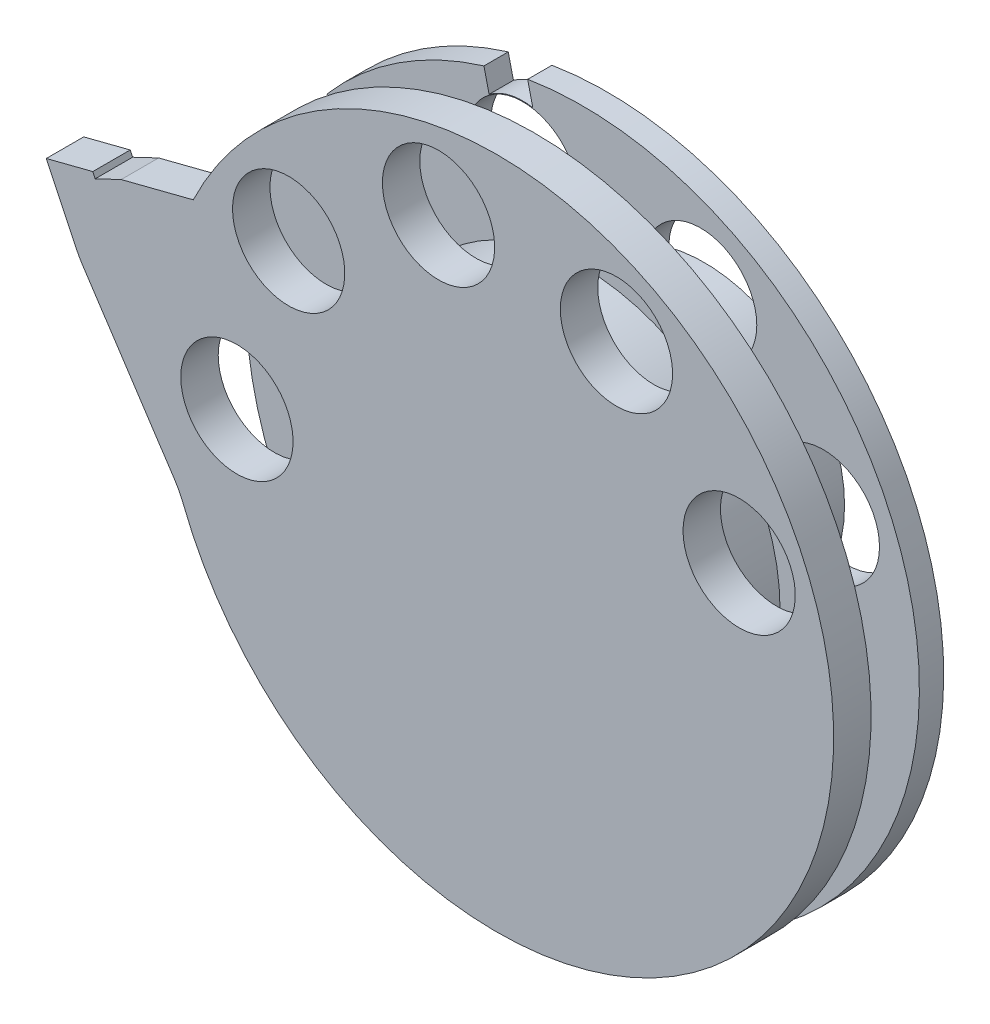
ISO-10303-21;
HEADER;
FILE_DESCRIPTION(('STEP AP214'),'2;1');
FILE_NAME('part.step','',(''),(''),'','','');
FILE_SCHEMA(('AUTOMOTIVE_DESIGN { 1 0 10303 214 1 1 1 1 }'));
ENDSEC;
DATA;
#1=APPLICATION_CONTEXT('core data for automotive mechanical design processes');
#2=APPLICATION_PROTOCOL_DEFINITION('international standard','automotive_design',2000,#1);
#3=PRODUCT_CONTEXT('',#1,'mechanical');
#4=PRODUCT('Part','Part','',(#3));
#5=PRODUCT_RELATED_PRODUCT_CATEGORY('part','',(#4));
#6=PRODUCT_DEFINITION_FORMATION('','',#4);
#7=PRODUCT_DEFINITION_CONTEXT('part definition',#1,'design');
#8=PRODUCT_DEFINITION('design','',#6,#7);
#9=PRODUCT_DEFINITION_SHAPE('','',#8);
#10=(LENGTH_UNIT() NAMED_UNIT(*) SI_UNIT(.MILLI.,.METRE.));
#11=(NAMED_UNIT(*) PLANE_ANGLE_UNIT() SI_UNIT($,.RADIAN.));
#12=(NAMED_UNIT(*) SI_UNIT($,.STERADIAN.) SOLID_ANGLE_UNIT());
#13=UNCERTAINTY_MEASURE_WITH_UNIT(LENGTH_MEASURE(1.E-05),#10,'distance_accuracy_value','');
#14=(GEOMETRIC_REPRESENTATION_CONTEXT(3) GLOBAL_UNCERTAINTY_ASSIGNED_CONTEXT((#13)) GLOBAL_UNIT_ASSIGNED_CONTEXT((#10,
#11,#12)) REPRESENTATION_CONTEXT('',''));
#15=CARTESIAN_POINT('',(0.,0.,0.));
#16=DIRECTION('',(0.,0.,1.));
#17=DIRECTION('',(1.,0.,0.));
#18=AXIS2_PLACEMENT_3D('',#15,#16,#17);
#19=CARTESIAN_POINT('',(0.,0.,1.3));
#20=DIRECTION('',(0.,0.,1.));
#21=DIRECTION('',(1.,0.,0.));
#22=AXIS2_PLACEMENT_3D('',#19,#20,#21);
#23=PLANE('',#22);
#24=CARTESIAN_POINT('',(6.30816552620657,12.4982817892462,1.3));
#25=DIRECTION('',(0.,0.,1.));
#26=DIRECTION('',(1.,0.,0.));
#27=AXIS2_PLACEMENT_3D('',#24,#25,#26);
#28=CIRCLE('',#27,3.00000000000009);
#29=CARTESIAN_POINT('',(9.30816552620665,12.4982817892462,1.3));
#30=VERTEX_POINT('',#29);
#31=EDGE_CURVE('E266',#30,#30,#28,.T.);
#32=ORIENTED_EDGE('',*,*,#31,.F.);
#33=EDGE_LOOP('',(#32));
#34=FACE_BOUND('',#33,.T.);
#35=CARTESIAN_POINT('',(-3.201405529,13.5914772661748,1.3));
#36=DIRECTION('',(0.,0.,1.));
#37=DIRECTION('',(1.,0.,0.));
#38=AXIS2_PLACEMENT_3D('',#35,#36,#37);
#39=CIRCLE('',#38,3.00000000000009);
#40=CARTESIAN_POINT('',(-0.201405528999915,13.5914772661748,1.3));
#41=VERTEX_POINT('',#40);
#42=EDGE_CURVE('E262',#41,#41,#39,.T.);
#43=ORIENTED_EDGE('',*,*,#42,.F.);
#44=EDGE_LOOP('',(#43));
#45=FACE_BOUND('',#44,.T.);
#46=CARTESIAN_POINT('',(12.866075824,5.519428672,1.3));
#47=DIRECTION('',(0.,0.,1.));
#48=DIRECTION('',(1.,0.,0.));
#49=AXIS2_PLACEMENT_3D('',#46,#47,#48);
#50=CIRCLE('',#49,3.00000000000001);
#51=CARTESIAN_POINT('',(15.866075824,5.519428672,1.3));
#52=VERTEX_POINT('',#51);
#53=EDGE_CURVE('E240',#52,#52,#50,.T.);
#54=ORIENTED_EDGE('',*,*,#53,.F.);
#55=EDGE_LOOP('',(#54));
#56=FACE_BOUND('',#55,.T.);
#57=CARTESIAN_POINT('',(0.,0.,1.3));
#58=DIRECTION('',(0.,0.,1.));
#59=DIRECTION('',(1.,0.,0.));
#60=AXIS2_PLACEMENT_3D('',#57,#58,#59);
#61=CIRCLE('',#60,10.55);
#62=CARTESIAN_POINT('',(10.55,0.,1.3));
#63=VERTEX_POINT('',#62);
#64=EDGE_CURVE('E256',#63,#63,#61,.T.);
#65=ORIENTED_EDGE('',*,*,#64,.F.);
#66=EDGE_LOOP('',(#65));
#67=FACE_BOUND('',#66,.T.);
#68=CARTESIAN_POINT('',(0.,0.,1.3));
#69=DIRECTION('',(0.,0.,1.));
#70=DIRECTION('',(1.,0.,0.));
#71=AXIS2_PLACEMENT_3D('',#68,#69,#70);
#72=CIRCLE('',#71,18.);
#73=CARTESIAN_POINT('',(-15.1031572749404,9.7925808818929,1.3));
#74=VERTEX_POINT('',#73);
#75=CARTESIAN_POINT('',(-17.9990009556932,0.189643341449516,1.3));
#76=VERTEX_POINT('',#75);
#77=EDGE_CURVE('E272',#74,#76,#72,.T.);
#78=ORIENTED_EDGE('',*,*,#77,.T.);
#79=DIRECTION('',(0.998422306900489,0.0561506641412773,0.));
#80=VECTOR('',#79,1.);
#81=CARTESIAN_POINT('',(-0.0673807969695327,1.19810676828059,1.3));
#82=LINE('',#81,#80);
#83=CARTESIAN_POINT('',(-16.7905005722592,0.257608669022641,1.3));
#84=VERTEX_POINT('',#83);
#85=EDGE_CURVE('E773',#76,#84,#82,.T.);
#86=ORIENTED_EDGE('',*,*,#85,.T.);
#87=CARTESIAN_POINT('',(-13.977912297,-0.786109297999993,1.3));
#88=DIRECTION('',(0.,0.,1.));
#89=DIRECTION('',(1.,0.,0.));
#90=AXIS2_PLACEMENT_3D('',#87,#88,#89);
#91=CIRCLE('',#90,3.00000000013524);
#92=CARTESIAN_POINT('',(-16.6557389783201,-2.13860486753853,1.3));
#93=VERTEX_POINT('',#92);
#94=EDGE_CURVE('E247',#93,#84,#91,.T.);
#95=ORIENTED_EDGE('',*,*,#94,.F.);
#96=DIRECTION('',(0.998422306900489,0.0561506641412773,0.));
#97=VECTOR('',#96,1.);
#98=CARTESIAN_POINT('',(0.0673807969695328,-1.19810676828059,1.3));
#99=LINE('',#98,#97);
#100=CARTESIAN_POINT('',(-17.8642393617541,-2.20657019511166,1.3));
#101=VERTEX_POINT('',#100);
#102=EDGE_CURVE('E770',#101,#93,#99,.T.);
#103=ORIENTED_EDGE('',*,*,#102,.F.);
#104=CARTESIAN_POINT('',(-2.93873148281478,17.7584869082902,1.3));
#105=VERTEX_POINT('',#104);
#106=EDGE_CURVE('E219',#101,#105,#72,.T.);
#107=ORIENTED_EDGE('',*,*,#106,.T.);
#108=DIRECTION('',(0.228671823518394,-0.973503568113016,0.));
#109=VECTOR('',#108,1.);
#110=CARTESIAN_POINT('',(1.16820428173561,0.274406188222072,1.3));
#111=LINE('',#110,#109);
#112=CARTESIAN_POINT('',(-2.66194481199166,16.5801484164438,1.3));
#113=VERTEX_POINT('',#112);
#114=EDGE_CURVE('E755',#105,#113,#111,.T.);
#115=ORIENTED_EDGE('',*,*,#114,.T.);
#116=CARTESIAN_POINT('',(-3.20140552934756,13.6290499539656,1.3));
#117=DIRECTION('',(0.,0.,1.));
#118=DIRECTION('',(1.,0.,0.));
#119=AXIS2_PLACEMENT_3D('',#116,#117,#118);
#120=CIRCLE('',#119,3.00000000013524);
#121=CARTESIAN_POINT('',(-4.99835337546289,16.0313360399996,1.3));
#122=VERTEX_POINT('',#121);
#123=EDGE_CURVE('E759',#113,#122,#120,.T.);
#124=ORIENTED_EDGE('',*,*,#123,.T.);
#125=DIRECTION('',(0.228671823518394,-0.973503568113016,0.));
#126=VECTOR('',#125,1.);
#127=CARTESIAN_POINT('',(-1.16820428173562,-0.274406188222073,1.3));
#128=LINE('',#127,#126);
#129=CARTESIAN_POINT('',(-5.27514004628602,17.209674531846,1.3));
#130=VERTEX_POINT('',#129);
#131=EDGE_CURVE('E712',#130,#122,#128,.T.);
#132=ORIENTED_EDGE('',*,*,#131,.F.);
#133=CARTESIAN_POINT('',(-13.6661342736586,11.7148100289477,1.3));
#134=VERTEX_POINT('',#133);
#135=EDGE_CURVE('E273',#130,#134,#72,.T.);
#136=ORIENTED_EDGE('',*,*,#135,.T.);
#137=DIRECTION('',(0.800928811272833,-0.598759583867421,0.));
#138=VECTOR('',#137,1.);
#139=CARTESIAN_POINT('',(0.71851150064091,0.961114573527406,1.3));
#140=LINE('',#139,#138);
#141=CARTESIAN_POINT('',(-12.6966819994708,10.9900654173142,1.3));
#142=VERTEX_POINT('',#141);
#143=EDGE_CURVE('E766',#134,#142,#140,.T.);
#144=ORIENTED_EDGE('',*,*,#143,.T.);
#145=CARTESIAN_POINT('',(-11.213003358,8.38263417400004,1.3));
#146=DIRECTION('',(0.,0.,1.));
#147=DIRECTION('',(1.,0.,0.));
#148=AXIS2_PLACEMENT_3D('',#145,#146,#147);
#149=CIRCLE('',#148,2.99999999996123);
#150=CARTESIAN_POINT('',(-14.1337050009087,9.06783627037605,1.3));
#151=VERTEX_POINT('',#150);
#152=EDGE_CURVE('E253',#151,#142,#149,.T.);
#153=ORIENTED_EDGE('',*,*,#152,.F.);
#154=DIRECTION('',(0.800928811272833,-0.598759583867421,0.));
#155=VECTOR('',#154,1.);
#156=CARTESIAN_POINT('',(-0.718511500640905,-0.961114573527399,1.3));
#157=LINE('',#156,#155);
#158=EDGE_CURVE('E763',#74,#151,#157,.T.);
#159=ORIENTED_EDGE('',*,*,#158,.F.);
#160=EDGE_LOOP('',(#78,#86,#95,#103,#107,#115,#124,#132,#136,#144,#153,#159));
#161=FACE_BOUND('',#160,.T.);
#162=ADVANCED_FACE('F53',(#34,#45,#56,#67,#161),#23,.T.);
#163=CARTESIAN_POINT('',(-11.213003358,8.38263417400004,1.3));
#164=DIRECTION('',(0.,0.,-1.));
#165=DIRECTION('',(-1.,0.,0.));
#166=AXIS2_PLACEMENT_3D('',#163,#164,#165);
#167=CYLINDRICAL_SURFACE('',#166,2.99999999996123);
#168=ORIENTED_EDGE('',*,*,#152,.T.);
#169=DIRECTION('',(0.,0.,-1.));
#170=VECTOR('',#169,1.);
#171=CARTESIAN_POINT('',(-12.6966819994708,10.9900654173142,2.5));
#172=LINE('',#171,#170);
#173=CARTESIAN_POINT('',(-12.6966819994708,10.9900654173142,0.));
#174=VERTEX_POINT('',#173);
#175=EDGE_CURVE('E725',#142,#174,#172,.T.);
#176=ORIENTED_EDGE('',*,*,#175,.T.);
#177=CARTESIAN_POINT('',(-11.213003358,8.38263417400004,0.));
#178=DIRECTION('',(0.,0.,1.));
#179=DIRECTION('',(1.,0.,0.));
#180=AXIS2_PLACEMENT_3D('',#177,#178,#179);
#181=CIRCLE('',#180,2.99999999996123);
#182=CARTESIAN_POINT('',(-14.1337050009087,9.06783627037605,0.));
#183=VERTEX_POINT('',#182);
#184=EDGE_CURVE('E282',#183,#174,#181,.T.);
#185=ORIENTED_EDGE('',*,*,#184,.F.);
#186=DIRECTION('',(0.,0.,-1.));
#187=VECTOR('',#186,1.);
#188=CARTESIAN_POINT('',(-14.1337050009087,9.06783627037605,2.5));
#189=LINE('',#188,#187);
#190=EDGE_CURVE('E732',#151,#183,#189,.T.);
#191=ORIENTED_EDGE('',*,*,#190,.F.);
#192=EDGE_LOOP('',(#168,#176,#185,#191));
#193=FACE_BOUND('',#192,.T.);
#194=ADVANCED_FACE('F308',(#193),#167,.F.);
#195=CARTESIAN_POINT('',(-13.977912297,-0.786109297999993,1.3));
#196=DIRECTION('',(0.,0.,-1.));
#197=DIRECTION('',(-1.,0.,0.));
#198=AXIS2_PLACEMENT_3D('',#195,#196,#197);
#199=CYLINDRICAL_SURFACE('',#198,3.00000000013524);
#200=ORIENTED_EDGE('',*,*,#94,.T.);
#201=DIRECTION('',(0.,0.,-1.));
#202=VECTOR('',#201,1.);
#203=CARTESIAN_POINT('',(-16.7905005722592,0.257608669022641,2.5));
#204=LINE('',#203,#202);
#205=CARTESIAN_POINT('',(-16.7905005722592,0.257608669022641,0.));
#206=VERTEX_POINT('',#205);
#207=EDGE_CURVE('E708',#84,#206,#204,.T.);
#208=ORIENTED_EDGE('',*,*,#207,.T.);
#209=CARTESIAN_POINT('',(-13.977912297,-0.786109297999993,0.));
#210=DIRECTION('',(0.,0.,1.));
#211=DIRECTION('',(1.,0.,0.));
#212=AXIS2_PLACEMENT_3D('',#209,#210,#211);
#213=CIRCLE('',#212,3.00000000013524);
#214=CARTESIAN_POINT('',(-16.6557389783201,-2.13860486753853,0.));
#215=VERTEX_POINT('',#214);
#216=EDGE_CURVE('E278',#215,#206,#213,.T.);
#217=ORIENTED_EDGE('',*,*,#216,.F.);
#218=DIRECTION('',(0.,0.,-1.));
#219=VECTOR('',#218,1.);
#220=CARTESIAN_POINT('',(-16.6557389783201,-2.13860486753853,2.5));
#221=LINE('',#220,#219);
#222=EDGE_CURVE('E203',#93,#215,#221,.T.);
#223=ORIENTED_EDGE('',*,*,#222,.F.);
#224=EDGE_LOOP('',(#200,#208,#217,#223));
#225=FACE_BOUND('',#224,.T.);
#226=ADVANCED_FACE('F314',(#225),#199,.F.);
#227=CARTESIAN_POINT('',(0.,0.,1.3));
#228=DIRECTION('',(0.,0.,-1.));
#229=DIRECTION('',(-1.,0.,0.));
#230=AXIS2_PLACEMENT_3D('',#227,#228,#229);
#231=CYLINDRICAL_SURFACE('',#230,18.);
#232=DIRECTION('',(0.,0.,-1.));
#233=VECTOR('',#232,1.);
#234=CARTESIAN_POINT('',(-17.9990009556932,0.189643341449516,2.5));
#235=LINE('',#234,#233);
#236=CARTESIAN_POINT('',(-17.9990009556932,0.189643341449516,0.));
#237=VERTEX_POINT('',#236);
#238=EDGE_CURVE('E77',#76,#237,#235,.T.);
#239=ORIENTED_EDGE('',*,*,#238,.F.);
#240=ORIENTED_EDGE('',*,*,#77,.F.);
#241=DIRECTION('',(0.,0.,-1.));
#242=VECTOR('',#241,1.);
#243=CARTESIAN_POINT('',(-15.1031572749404,9.7925808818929,2.5));
#244=LINE('',#243,#242);
#245=CARTESIAN_POINT('',(-15.1031572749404,9.7925808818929,0.));
#246=VERTEX_POINT('',#245);
#247=EDGE_CURVE('E728',#74,#246,#244,.T.);
#248=ORIENTED_EDGE('',*,*,#247,.T.);
#249=CARTESIAN_POINT('',(0.,0.,0.));
#250=DIRECTION('',(0.,0.,1.));
#251=DIRECTION('',(1.,0.,0.));
#252=AXIS2_PLACEMENT_3D('',#249,#250,#251);
#253=CIRCLE('',#252,18.);
#254=EDGE_CURVE('E227',#246,#237,#253,.T.);
#255=ORIENTED_EDGE('',*,*,#254,.T.);
#256=EDGE_LOOP('',(#239,#240,#248,#255));
#257=FACE_BOUND('',#256,.T.);
#258=ADVANCED_FACE('F325',(#257),#231,.T.);
#259=DIRECTION('',(0.,0.,-1.));
#260=VECTOR('',#259,1.);
#261=CARTESIAN_POINT('',(-13.6661342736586,11.7148100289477,2.5));
#262=LINE('',#261,#260);
#263=CARTESIAN_POINT('',(-13.6661342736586,11.7148100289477,0.));
#264=VERTEX_POINT('',#263);
#265=EDGE_CURVE('E210',#134,#264,#262,.T.);
#266=ORIENTED_EDGE('',*,*,#265,.F.);
#267=ORIENTED_EDGE('',*,*,#135,.F.);
#268=DIRECTION('',(0.,0.,-1.));
#269=VECTOR('',#268,1.);
#270=CARTESIAN_POINT('',(-5.27514004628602,17.209674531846,2.5));
#271=LINE('',#270,#269);
#272=CARTESIAN_POINT('',(-5.27514004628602,17.209674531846,0.));
#273=VERTEX_POINT('',#272);
#274=EDGE_CURVE('E748',#130,#273,#271,.T.);
#275=ORIENTED_EDGE('',*,*,#274,.T.);
#276=EDGE_CURVE('E230',#273,#264,#253,.T.);
#277=ORIENTED_EDGE('',*,*,#276,.T.);
#278=EDGE_LOOP('',(#266,#267,#275,#277));
#279=FACE_BOUND('',#278,.T.);
#280=ADVANCED_FACE('F327',(#279),#231,.T.);
#281=ORIENTED_EDGE('',*,*,#106,.F.);
#282=DIRECTION('',(0.,0.,-1.));
#283=VECTOR('',#282,1.);
#284=CARTESIAN_POINT('',(-17.8642393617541,-2.20657019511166,2.5));
#285=LINE('',#284,#283);
#286=CARTESIAN_POINT('',(-17.8642393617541,-2.20657019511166,0.));
#287=VERTEX_POINT('',#286);
#288=EDGE_CURVE('E200',#101,#287,#285,.T.);
#289=ORIENTED_EDGE('',*,*,#288,.T.);
#290=CARTESIAN_POINT('',(-2.93873148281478,17.7584869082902,0.));
#291=VERTEX_POINT('',#290);
#292=EDGE_CURVE('E217',#287,#291,#253,.T.);
#293=ORIENTED_EDGE('',*,*,#292,.T.);
#294=DIRECTION('',(0.,0.,-1.));
#295=VECTOR('',#294,1.);
#296=CARTESIAN_POINT('',(-2.93873148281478,17.7584869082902,2.5));
#297=LINE('',#296,#295);
#298=EDGE_CURVE('E745',#105,#291,#297,.T.);
#299=ORIENTED_EDGE('',*,*,#298,.F.);
#300=EDGE_LOOP('',(#281,#289,#293,#299));
#301=FACE_BOUND('',#300,.T.);
#302=ADVANCED_FACE('F215',(#301),#231,.T.);
#303=CARTESIAN_POINT('',(0.,0.,0.));
#304=DIRECTION('',(0.,0.,1.));
#305=DIRECTION('',(1.,0.,0.));
#306=AXIS2_PLACEMENT_3D('',#303,#304,#305);
#307=PLANE('',#306);
#308=CARTESIAN_POINT('',(6.30816552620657,12.4982817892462,0.));
#309=DIRECTION('',(0.,0.,1.));
#310=DIRECTION('',(1.,0.,0.));
#311=AXIS2_PLACEMENT_3D('',#308,#309,#310);
#312=CIRCLE('',#311,3.00000000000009);
#313=CARTESIAN_POINT('',(9.30816552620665,12.4982817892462,0.));
#314=VERTEX_POINT('',#313);
#315=EDGE_CURVE('E228',#314,#314,#312,.T.);
#316=ORIENTED_EDGE('',*,*,#315,.T.);
#317=EDGE_LOOP('',(#316));
#318=FACE_BOUND('',#317,.T.);
#319=CARTESIAN_POINT('',(-3.201405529,13.5914772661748,0.));
#320=DIRECTION('',(0.,0.,1.));
#321=DIRECTION('',(1.,0.,0.));
#322=AXIS2_PLACEMENT_3D('',#319,#320,#321);
#323=CIRCLE('',#322,3.00000000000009);
#324=CARTESIAN_POINT('',(-0.201405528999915,13.5914772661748,0.));
#325=VERTEX_POINT('',#324);
#326=EDGE_CURVE('E235',#325,#325,#323,.T.);
#327=ORIENTED_EDGE('',*,*,#326,.T.);
#328=EDGE_LOOP('',(#327));
#329=FACE_BOUND('',#328,.T.);
#330=CARTESIAN_POINT('',(12.866075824,5.519428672,0.));
#331=DIRECTION('',(0.,0.,1.));
#332=DIRECTION('',(1.,0.,0.));
#333=AXIS2_PLACEMENT_3D('',#330,#331,#332);
#334=CIRCLE('',#333,3.00000000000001);
#335=CARTESIAN_POINT('',(15.866075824,5.519428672,0.));
#336=VERTEX_POINT('',#335);
#337=EDGE_CURVE('E274',#336,#336,#334,.T.);
#338=ORIENTED_EDGE('',*,*,#337,.T.);
#339=EDGE_LOOP('',(#338));
#340=FACE_BOUND('',#339,.T.);
#341=CARTESIAN_POINT('',(0.,0.,0.));
#342=DIRECTION('',(0.,0.,1.));
#343=DIRECTION('',(1.,0.,0.));
#344=AXIS2_PLACEMENT_3D('',#341,#342,#343);
#345=CIRCLE('',#344,10.25);
#346=CARTESIAN_POINT('',(10.25,0.,0.));
#347=VERTEX_POINT('',#346);
#348=EDGE_CURVE('E927',#347,#347,#345,.T.);
#349=ORIENTED_EDGE('',*,*,#348,.T.);
#350=EDGE_LOOP('',(#349));
#351=FACE_BOUND('',#350,.T.);
#352=DIRECTION('',(-0.998422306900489,-0.0561506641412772,0.));
#353=VECTOR('',#352,1.);
#354=CARTESIAN_POINT('',(-0.0673807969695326,1.19810676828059,0.));
#355=LINE('',#354,#353);
#356=EDGE_CURVE('E209',#206,#237,#355,.T.);
#357=ORIENTED_EDGE('',*,*,#356,.T.);
#358=ORIENTED_EDGE('',*,*,#254,.F.);
#359=DIRECTION('',(-0.800928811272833,0.598759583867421,0.));
#360=VECTOR('',#359,1.);
#361=CARTESIAN_POINT('',(-0.718511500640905,-0.961114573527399,0.));
#362=LINE('',#361,#360);
#363=EDGE_CURVE('E721',#183,#246,#362,.T.);
#364=ORIENTED_EDGE('',*,*,#363,.F.);
#365=ORIENTED_EDGE('',*,*,#184,.T.);
#366=DIRECTION('',(-0.800928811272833,0.598759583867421,0.));
#367=VECTOR('',#366,1.);
#368=CARTESIAN_POINT('',(0.71851150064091,0.961114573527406,0.));
#369=LINE('',#368,#367);
#370=EDGE_CURVE('E717',#174,#264,#369,.T.);
#371=ORIENTED_EDGE('',*,*,#370,.T.);
#372=ORIENTED_EDGE('',*,*,#276,.F.);
#373=DIRECTION('',(-0.228671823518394,0.973503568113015,0.));
#374=VECTOR('',#373,1.);
#375=CARTESIAN_POINT('',(-1.16820428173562,-0.274406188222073,0.));
#376=LINE('',#375,#374);
#377=CARTESIAN_POINT('',(-4.9983533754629,16.0313360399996,0.));
#378=VERTEX_POINT('',#377);
#379=EDGE_CURVE('E701',#378,#273,#376,.T.);
#380=ORIENTED_EDGE('',*,*,#379,.F.);
#381=CARTESIAN_POINT('',(-3.20140552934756,13.6290499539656,0.));
#382=DIRECTION('',(0.,0.,-1.));
#383=DIRECTION('',(-1.,0.,0.));
#384=AXIS2_PLACEMENT_3D('',#381,#382,#383);
#385=CIRCLE('',#384,3.00000000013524);
#386=CARTESIAN_POINT('',(-2.66194481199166,16.5801484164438,0.));
#387=VERTEX_POINT('',#386);
#388=EDGE_CURVE('E69',#378,#387,#385,.T.);
#389=ORIENTED_EDGE('',*,*,#388,.T.);
#390=DIRECTION('',(-0.228671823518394,0.973503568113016,0.));
#391=VECTOR('',#390,1.);
#392=CARTESIAN_POINT('',(1.16820428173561,0.274406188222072,0.));
#393=LINE('',#392,#391);
#394=EDGE_CURVE('E225',#387,#291,#393,.T.);
#395=ORIENTED_EDGE('',*,*,#394,.T.);
#396=ORIENTED_EDGE('',*,*,#292,.F.);
#397=DIRECTION('',(-0.998422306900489,-0.0561506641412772,0.));
#398=VECTOR('',#397,1.);
#399=CARTESIAN_POINT('',(0.0673807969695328,-1.19810676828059,0.));
#400=LINE('',#399,#398);
#401=EDGE_CURVE('E197',#215,#287,#400,.T.);
#402=ORIENTED_EDGE('',*,*,#401,.F.);
#403=ORIENTED_EDGE('',*,*,#216,.T.);
#404=EDGE_LOOP('',(#357,#358,#364,#365,#371,#372,#380,#389,#395,#396,#402,#403));
#405=FACE_BOUND('',#404,.T.);
#406=ADVANCED_FACE('F223',(#318,#329,#340,#351,#405),#307,.F.);
#407=CARTESIAN_POINT('',(6.30816552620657,12.4982817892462,1.3));
#408=DIRECTION('',(0.,0.,-1.));
#409=DIRECTION('',(-1.,0.,0.));
#410=AXIS2_PLACEMENT_3D('',#407,#408,#409);
#411=CYLINDRICAL_SURFACE('',#410,3.00000000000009);
#412=ORIENTED_EDGE('',*,*,#31,.T.);
#413=EDGE_LOOP('',(#412));
#414=FACE_BOUND('',#413,.T.);
#415=ORIENTED_EDGE('',*,*,#315,.F.);
#416=EDGE_LOOP('',(#415));
#417=FACE_BOUND('',#416,.T.);
#418=ADVANCED_FACE('F295',(#414,#417),#411,.F.);
#419=CARTESIAN_POINT('',(-3.201405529,13.5914772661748,1.3));
#420=DIRECTION('',(0.,0.,-1.));
#421=DIRECTION('',(-1.,0.,0.));
#422=AXIS2_PLACEMENT_3D('',#419,#420,#421);
#423=CYLINDRICAL_SURFACE('',#422,3.00000000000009);
#424=ORIENTED_EDGE('',*,*,#42,.T.);
#425=EDGE_LOOP('',(#424));
#426=FACE_BOUND('',#425,.T.);
#427=ORIENTED_EDGE('',*,*,#326,.F.);
#428=EDGE_LOOP('',(#427));
#429=FACE_BOUND('',#428,.T.);
#430=ADVANCED_FACE('F292',(#426,#429),#423,.F.);
#431=CARTESIAN_POINT('',(12.866075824,5.519428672,1.3));
#432=DIRECTION('',(0.,0.,-1.));
#433=DIRECTION('',(-1.,0.,0.));
#434=AXIS2_PLACEMENT_3D('',#431,#432,#433);
#435=CYLINDRICAL_SURFACE('',#434,3.00000000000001);
#436=ORIENTED_EDGE('',*,*,#53,.T.);
#437=EDGE_LOOP('',(#436));
#438=FACE_BOUND('',#437,.T.);
#439=ORIENTED_EDGE('',*,*,#337,.F.);
#440=EDGE_LOOP('',(#439));
#441=FACE_BOUND('',#440,.T.);
#442=ADVANCED_FACE('F294',(#438,#441),#435,.F.);
#443=CARTESIAN_POINT('',(0.,0.,1.3));
#444=DIRECTION('',(0.,0.,-1.));
#445=DIRECTION('',(-1.,0.,0.));
#446=AXIS2_PLACEMENT_3D('',#443,#444,#445);
#447=CYLINDRICAL_SURFACE('',#446,9.25);
#448=CARTESIAN_POINT('',(0.,0.,1.));
#449=DIRECTION('',(0.,0.,1.));
#450=DIRECTION('',(1.,0.,0.));
#451=AXIS2_PLACEMENT_3D('',#448,#449,#450);
#452=CIRCLE('',#451,9.25);
#453=CARTESIAN_POINT('',(9.25,0.,1.));
#454=VERTEX_POINT('',#453);
#455=EDGE_CURVE('E62',#454,#454,#452,.F.);
#456=ORIENTED_EDGE('',*,*,#455,.T.);
#457=EDGE_LOOP('',(#456));
#458=FACE_BOUND('',#457,.T.);
#459=CARTESIAN_POINT('',(0.,0.,2.8));
#460=DIRECTION('',(0.,0.,-1.));
#461=DIRECTION('',(-1.,0.,0.));
#462=AXIS2_PLACEMENT_3D('',#459,#460,#461);
#463=CIRCLE('',#462,9.25);
#464=CARTESIAN_POINT('',(-9.25,0.,2.8));
#465=VERTEX_POINT('',#464);
#466=EDGE_CURVE('E932',#465,#465,#463,.F.);
#467=ORIENTED_EDGE('',*,*,#466,.T.);
#468=EDGE_LOOP('',(#467));
#469=FACE_BOUND('',#468,.T.);
#470=ADVANCED_FACE('F302',(#458,#469),#447,.F.);
#471=CARTESIAN_POINT('',(0.,0.,3.8));
#472=DIRECTION('',(0.,0.,-1.));
#473=DIRECTION('',(-1.,0.,0.));
#474=AXIS2_PLACEMENT_3D('',#471,#472,#473);
#475=CYLINDRICAL_SURFACE('',#474,10.55);
#476=CARTESIAN_POINT('',(0.,0.,3.8));
#477=DIRECTION('',(0.,0.,1.));
#478=DIRECTION('',(1.,0.,0.));
#479=AXIS2_PLACEMENT_3D('',#476,#477,#478);
#480=CIRCLE('',#479,10.55);
#481=CARTESIAN_POINT('',(10.55,0.,3.8));
#482=VERTEX_POINT('',#481);
#483=EDGE_CURVE('E279',#482,#482,#480,.T.);
#484=ORIENTED_EDGE('',*,*,#483,.F.);
#485=EDGE_LOOP('',(#484));
#486=FACE_BOUND('',#485,.T.);
#487=ORIENTED_EDGE('',*,*,#64,.T.);
#488=EDGE_LOOP('',(#487));
#489=FACE_BOUND('',#488,.T.);
#490=ADVANCED_FACE('F320',(#486,#489),#475,.T.);
#491=CARTESIAN_POINT('',(-18.0493442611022,4.50971566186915,3.8));
#492=DIRECTION('',(0.,0.,-1.));
#493=DIRECTION('',(-1.,0.,0.));
#494=AXIS2_PLACEMENT_3D('',#491,#492,#493);
#495=PLANE('',#494);
#496=CARTESIAN_POINT('',(0.,0.,3.8));
#497=DIRECTION('',(0.,0.,-1.));
#498=DIRECTION('',(-1.,0.,0.));
#499=AXIS2_PLACEMENT_3D('',#496,#497,#498);
#500=CIRCLE('',#499,7.5);
#501=CARTESIAN_POINT('',(-7.5,0.,3.8));
#502=VERTEX_POINT('',#501);
#503=EDGE_CURVE('E697',#502,#502,#500,.T.);
#504=ORIENTED_EDGE('',*,*,#503,.F.);
#505=EDGE_LOOP('',(#504));
#506=FACE_BOUND('',#505,.T.);
#507=CARTESIAN_POINT('',(0.,0.,3.8));
#508=DIRECTION('',(0.,0.,-1.));
#509=DIRECTION('',(-1.,0.,0.));
#510=AXIS2_PLACEMENT_3D('',#507,#508,#509);
#511=CIRCLE('',#510,8.25);
#512=CARTESIAN_POINT('',(-8.25,0.,3.8));
#513=VERTEX_POINT('',#512);
#514=EDGE_CURVE('E13',#513,#513,#511,.T.);
#515=ORIENTED_EDGE('',*,*,#514,.T.);
#516=EDGE_LOOP('',(#515));
#517=FACE_BOUND('',#516,.T.);
#518=ADVANCED_FACE('F373',(#506,#517),#495,.T.);
#519=CARTESIAN_POINT('',(-18.0493442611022,4.50971566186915,5.8));
#520=DIRECTION('',(0.,0.,-1.));
#521=DIRECTION('',(-1.,0.,0.));
#522=AXIS2_PLACEMENT_3D('',#519,#520,#521);
#523=CYLINDRICAL_SURFACE('',#522,5.00000000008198);
#524=CARTESIAN_POINT('',(-18.0493442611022,4.50971566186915,3.8));
#525=DIRECTION('',(0.,0.,1.));
#526=DIRECTION('',(-1.,0.,0.));
#527=AXIS2_PLACEMENT_3D('',#524,#525,#526);
#528=CIRCLE('',#527,5.00000000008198);
#529=CARTESIAN_POINT('',(-22.564231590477,2.36127613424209,3.8));
#530=VERTEX_POINT('',#529);
#531=CARTESIAN_POINT('',(-22.2248850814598,1.75928681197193,3.8));
#532=VERTEX_POINT('',#531);
#533=EDGE_CURVE('E817',#530,#532,#528,.T.);
#534=ORIENTED_EDGE('',*,*,#533,.T.);
#535=DIRECTION('',(0.,0.,-1.));
#536=VECTOR('',#535,1.);
#537=CARTESIAN_POINT('',(-22.2248850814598,1.75928681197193,5.8));
#538=LINE('',#537,#536);
#539=CARTESIAN_POINT('',(-22.2248850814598,1.75928681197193,5.8));
#540=VERTEX_POINT('',#539);
#541=EDGE_CURVE('E906',#540,#532,#538,.T.);
#542=ORIENTED_EDGE('',*,*,#541,.F.);
#543=CARTESIAN_POINT('',(-18.0493442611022,4.50971566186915,5.8));
#544=DIRECTION('',(0.,0.,1.));
#545=DIRECTION('',(-1.,0.,0.));
#546=AXIS2_PLACEMENT_3D('',#543,#544,#545);
#547=CIRCLE('',#546,5.00000000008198);
#548=CARTESIAN_POINT('',(-22.564231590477,2.36127613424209,5.8));
#549=VERTEX_POINT('',#548);
#550=EDGE_CURVE('E818',#549,#540,#547,.T.);
#551=ORIENTED_EDGE('',*,*,#550,.F.);
#552=DIRECTION('',(0.,0.,-1.));
#553=VECTOR('',#552,1.);
#554=CARTESIAN_POINT('',(-22.564231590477,2.36127613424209,5.8));
#555=LINE('',#554,#553);
#556=EDGE_CURVE('E847',#549,#530,#555,.T.);
#557=ORIENTED_EDGE('',*,*,#556,.T.);
#558=EDGE_LOOP('',(#534,#542,#551,#557));
#559=FACE_BOUND('',#558,.T.);
#560=ADVANCED_FACE('F381',(#559),#523,.T.);
#561=CARTESIAN_POINT('',(-17.320583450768,-5.68613816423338,5.8));
#562=DIRECTION('',(0.835108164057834,0.550085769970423,0.));
#563=DIRECTION('',(-0.550085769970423,0.835108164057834,0.));
#564=AXIS2_PLACEMENT_3D('',#561,#562,#563);
#565=PLANE('',#564);
#566=DIRECTION('',(0.550085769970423,-0.835108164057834,0.));
#567=VECTOR('',#566,1.);
#568=CARTESIAN_POINT('',(-17.320583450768,-5.68613816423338,3.8));
#569=LINE('',#568,#567);
#570=CARTESIAN_POINT('',(-17.320583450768,-5.68613816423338,3.8));
#571=VERTEX_POINT('',#570);
#572=EDGE_CURVE('E851',#532,#571,#569,.T.);
#573=ORIENTED_EDGE('',*,*,#572,.T.);
#574=DIRECTION('',(0.,0.,-1.));
#575=VECTOR('',#574,1.);
#576=CARTESIAN_POINT('',(-17.320583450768,-5.68613816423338,5.8));
#577=LINE('',#576,#575);
#578=CARTESIAN_POINT('',(-17.320583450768,-5.68613816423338,5.8));
#579=VERTEX_POINT('',#578);
#580=EDGE_CURVE('E902',#579,#571,#577,.T.);
#581=ORIENTED_EDGE('',*,*,#580,.F.);
#582=DIRECTION('',(0.550085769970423,-0.835108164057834,0.));
#583=VECTOR('',#582,1.);
#584=CARTESIAN_POINT('',(-17.320583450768,-5.68613816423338,5.8));
#585=LINE('',#584,#583);
#586=EDGE_CURVE('E822',#540,#579,#585,.T.);
#587=ORIENTED_EDGE('',*,*,#586,.F.);
#588=ORIENTED_EDGE('',*,*,#541,.T.);
#589=EDGE_LOOP('',(#573,#581,#587,#588));
#590=FACE_BOUND('',#589,.T.);
#591=ADVANCED_FACE('F386',(#590),#565,.F.);
#592=CARTESIAN_POINT('',(-21.4961242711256,-8.43656701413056,5.8));
#593=DIRECTION('',(0.,0.,-1.));
#594=DIRECTION('',(-1.,0.,0.));
#595=AXIS2_PLACEMENT_3D('',#592,#593,#594);
#596=CYLINDRICAL_SURFACE('',#595,5.00000000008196);
#597=CARTESIAN_POINT('',(-21.4961242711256,-8.43656701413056,3.8));
#598=DIRECTION('',(0.,0.,-1.));
#599=DIRECTION('',(-1.,0.,0.));
#600=AXIS2_PLACEMENT_3D('',#597,#598,#599);
#601=CIRCLE('',#600,5.00000000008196);
#602=CARTESIAN_POINT('',(-16.840978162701,-6.61184382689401,3.8));
#603=VERTEX_POINT('',#602);
#604=EDGE_CURVE('E854',#571,#603,#601,.T.);
#605=ORIENTED_EDGE('',*,*,#604,.T.);
#606=DIRECTION('',(0.,0.,-1.));
#607=VECTOR('',#606,1.);
#608=CARTESIAN_POINT('',(-16.840978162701,-6.61184382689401,5.8));
#609=LINE('',#608,#607);
#610=CARTESIAN_POINT('',(-16.840978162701,-6.61184382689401,5.8));
#611=VERTEX_POINT('',#610);
#612=EDGE_CURVE('E898',#611,#603,#609,.T.);
#613=ORIENTED_EDGE('',*,*,#612,.F.);
#614=CARTESIAN_POINT('',(-21.4961242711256,-8.43656701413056,5.8));
#615=DIRECTION('',(0.,0.,-1.));
#616=DIRECTION('',(-1.,0.,0.));
#617=AXIS2_PLACEMENT_3D('',#614,#615,#616);
#618=CIRCLE('',#617,5.00000000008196);
#619=EDGE_CURVE('E826',#579,#611,#618,.T.);
#620=ORIENTED_EDGE('',*,*,#619,.F.);
#621=ORIENTED_EDGE('',*,*,#580,.T.);
#622=EDGE_LOOP('',(#605,#613,#620,#621));
#623=FACE_BOUND('',#622,.T.);
#624=ADVANCED_FACE('F395',(#623),#596,.F.);
#625=CARTESIAN_POINT('',(-0.0824520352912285,-0.0428402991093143,5.8));
#626=DIRECTION('',(0.,0.,-1.));
#627=DIRECTION('',(-1.,0.,0.));
#628=AXIS2_PLACEMENT_3D('',#625,#626,#627);
#629=CYLINDRICAL_SURFACE('',#628,18.0000001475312);
#630=CARTESIAN_POINT('',(-0.0824520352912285,-0.0428402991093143,3.8));
#631=DIRECTION('',(0.,0.,1.));
#632=DIRECTION('',(-1.,0.,0.));
#633=AXIS2_PLACEMENT_3D('',#630,#631,#632);
#634=CIRCLE('',#633,18.0000001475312);
#635=CARTESIAN_POINT('',(-16.3112640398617,7.74340823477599,3.8));
#636=VERTEX_POINT('',#635);
#637=EDGE_CURVE('E858',#603,#636,#634,.T.);
#638=ORIENTED_EDGE('',*,*,#637,.T.);
#639=DIRECTION('',(0.,0.,-1.));
#640=VECTOR('',#639,1.);
#641=CARTESIAN_POINT('',(-16.3112640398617,7.74340823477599,5.8));
#642=LINE('',#641,#640);
#643=CARTESIAN_POINT('',(-16.3112640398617,7.74340823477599,5.8));
#644=VERTEX_POINT('',#643);
#645=EDGE_CURVE('E894',#644,#636,#642,.T.);
#646=ORIENTED_EDGE('',*,*,#645,.F.);
#647=CARTESIAN_POINT('',(-0.0824520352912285,-0.0428402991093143,5.8));
#648=DIRECTION('',(0.,0.,1.));
#649=DIRECTION('',(-1.,0.,0.));
#650=AXIS2_PLACEMENT_3D('',#647,#648,#649);
#651=CIRCLE('',#650,18.0000001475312);
#652=EDGE_CURVE('E829',#611,#644,#651,.T.);
#653=ORIENTED_EDGE('',*,*,#652,.F.);
#654=ORIENTED_EDGE('',*,*,#612,.T.);
#655=EDGE_LOOP('',(#638,#646,#653,#654));
#656=FACE_BOUND('',#655,.T.);
#657=ADVANCED_FACE('F405',(#656),#629,.T.);
#658=CARTESIAN_POINT('',(-20.1631538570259,6.75557326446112,5.8));
#659=DIRECTION('',(0.248415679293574,-0.968653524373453,0.));
#660=DIRECTION('',(0.968653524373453,0.248415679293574,0.));
#661=AXIS2_PLACEMENT_3D('',#658,#659,#660);
#662=PLANE('',#661);
#663=DIRECTION('',(-0.968653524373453,-0.248415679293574,0.));
#664=VECTOR('',#663,1.);
#665=CARTESIAN_POINT('',(-20.1631538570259,6.75557326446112,3.8));
#666=LINE('',#665,#664);
#667=CARTESIAN_POINT('',(-20.1631538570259,6.75557326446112,3.8));
#668=VERTEX_POINT('',#667);
#669=EDGE_CURVE('E861',#636,#668,#666,.T.);
#670=ORIENTED_EDGE('',*,*,#669,.T.);
#671=DIRECTION('',(0.,0.,-1.));
#672=VECTOR('',#671,1.);
#673=CARTESIAN_POINT('',(-20.1631538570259,6.75557326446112,5.8));
#674=LINE('',#673,#672);
#675=CARTESIAN_POINT('',(-20.1631538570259,6.75557326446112,5.8));
#676=VERTEX_POINT('',#675);
#677=EDGE_CURVE('E890',#676,#668,#674,.T.);
#678=ORIENTED_EDGE('',*,*,#677,.F.);
#679=DIRECTION('',(-0.968653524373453,-0.248415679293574,0.));
#680=VECTOR('',#679,1.);
#681=CARTESIAN_POINT('',(-20.1631538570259,6.75557326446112,5.8));
#682=LINE('',#681,#680);
#683=EDGE_CURVE('E832',#644,#676,#682,.T.);
#684=ORIENTED_EDGE('',*,*,#683,.F.);
#685=ORIENTED_EDGE('',*,*,#645,.T.);
#686=EDGE_LOOP('',(#670,#678,#684,#685));
#687=FACE_BOUND('',#686,.T.);
#688=ADVANCED_FACE('F416',(#687),#662,.F.);
#689=CARTESIAN_POINT('',(-21.5522452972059,6.09456475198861,5.8));
#690=DIRECTION('',(0.429687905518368,-0.902977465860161,0.));
#691=DIRECTION('',(0.902977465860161,0.429687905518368,0.));
#692=AXIS2_PLACEMENT_3D('',#689,#690,#691);
#693=PLANE('',#692);
#694=DIRECTION('',(-0.902977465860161,-0.429687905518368,0.));
#695=VECTOR('',#694,1.);
#696=CARTESIAN_POINT('',(-21.5522452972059,6.09456475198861,3.8));
#697=LINE('',#696,#695);
#698=CARTESIAN_POINT('',(-21.5522452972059,6.09456475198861,3.8));
#699=VERTEX_POINT('',#698);
#700=EDGE_CURVE('E864',#668,#699,#697,.T.);
#701=ORIENTED_EDGE('',*,*,#700,.T.);
#702=DIRECTION('',(0.,0.,-1.));
#703=VECTOR('',#702,1.);
#704=CARTESIAN_POINT('',(-21.5522452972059,6.09456475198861,5.8));
#705=LINE('',#704,#703);
#706=CARTESIAN_POINT('',(-21.5522452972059,6.09456475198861,5.8));
#707=VERTEX_POINT('',#706);
#708=EDGE_CURVE('E886',#707,#699,#705,.T.);
#709=ORIENTED_EDGE('',*,*,#708,.F.);
#710=DIRECTION('',(-0.902977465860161,-0.429687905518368,0.));
#711=VECTOR('',#710,1.);
#712=CARTESIAN_POINT('',(-21.5522452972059,6.09456475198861,5.8));
#713=LINE('',#712,#711);
#714=EDGE_CURVE('E835',#676,#707,#713,.T.);
#715=ORIENTED_EDGE('',*,*,#714,.F.);
#716=ORIENTED_EDGE('',*,*,#677,.T.);
#717=EDGE_LOOP('',(#701,#709,#715,#716));
#718=FACE_BOUND('',#717,.T.);
#719=ADVANCED_FACE('F426',(#718),#693,.F.);
#720=CARTESIAN_POINT('',(-21.6814984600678,6.3661867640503,5.8));
#721=DIRECTION('',(-0.902977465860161,-0.429687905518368,0.));
#722=DIRECTION('',(0.429687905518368,-0.902977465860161,0.));
#723=AXIS2_PLACEMENT_3D('',#720,#721,#722);
#724=PLANE('',#723);
#725=DIRECTION('',(-0.429687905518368,0.902977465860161,0.));
#726=VECTOR('',#725,1.);
#727=CARTESIAN_POINT('',(-21.6814984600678,6.3661867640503,3.8));
#728=LINE('',#727,#726);
#729=CARTESIAN_POINT('',(-21.6814984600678,6.3661867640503,3.8));
#730=VERTEX_POINT('',#729);
#731=EDGE_CURVE('E867',#699,#730,#728,.T.);
#732=ORIENTED_EDGE('',*,*,#731,.T.);
#733=DIRECTION('',(0.,0.,-1.));
#734=VECTOR('',#733,1.);
#735=CARTESIAN_POINT('',(-21.6814984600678,6.3661867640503,5.8));
#736=LINE('',#735,#734);
#737=CARTESIAN_POINT('',(-21.6814984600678,6.3661867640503,5.8));
#738=VERTEX_POINT('',#737);
#739=EDGE_CURVE('E882',#738,#730,#736,.T.);
#740=ORIENTED_EDGE('',*,*,#739,.F.);
#741=DIRECTION('',(-0.429687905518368,0.902977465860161,0.));
#742=VECTOR('',#741,1.);
#743=CARTESIAN_POINT('',(-21.6814984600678,6.3661867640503,5.8));
#744=LINE('',#743,#742);
#745=EDGE_CURVE('E838',#707,#738,#744,.T.);
#746=ORIENTED_EDGE('',*,*,#745,.F.);
#747=ORIENTED_EDGE('',*,*,#708,.T.);
#748=EDGE_LOOP('',(#732,#740,#746,#747));
#749=FACE_BOUND('',#748,.T.);
#750=ADVANCED_FACE('F436',(#749),#724,.F.);
#751=CARTESIAN_POINT('',(-24.1667107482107,5.72884257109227,5.8));
#752=DIRECTION('',(0.248415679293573,-0.968653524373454,0.));
#753=DIRECTION('',(0.968653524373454,0.248415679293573,0.));
#754=AXIS2_PLACEMENT_3D('',#751,#752,#753);
#755=PLANE('',#754);
#756=DIRECTION('',(-0.968653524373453,-0.248415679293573,0.));
#757=VECTOR('',#756,1.);
#758=CARTESIAN_POINT('',(-24.1667107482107,5.72884257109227,3.8));
#759=LINE('',#758,#757);
#760=CARTESIAN_POINT('',(-24.1667107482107,5.72884257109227,3.8));
#761=VERTEX_POINT('',#760);
#762=EDGE_CURVE('E870',#730,#761,#759,.T.);
#763=ORIENTED_EDGE('',*,*,#762,.T.);
#764=DIRECTION('',(0.,0.,-1.));
#765=VECTOR('',#764,1.);
#766=CARTESIAN_POINT('',(-24.1667107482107,5.72884257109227,5.8));
#767=LINE('',#766,#765);
#768=CARTESIAN_POINT('',(-24.1667107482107,5.72884257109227,5.8));
#769=VERTEX_POINT('',#768);
#770=EDGE_CURVE('E878',#769,#761,#767,.T.);
#771=ORIENTED_EDGE('',*,*,#770,.F.);
#772=DIRECTION('',(-0.968653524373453,-0.248415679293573,0.));
#773=VECTOR('',#772,1.);
#774=CARTESIAN_POINT('',(-24.1667107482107,5.72884257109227,5.8));
#775=LINE('',#774,#773);
#776=EDGE_CURVE('E841',#738,#769,#775,.T.);
#777=ORIENTED_EDGE('',*,*,#776,.F.);
#778=ORIENTED_EDGE('',*,*,#739,.T.);
#779=EDGE_LOOP('',(#763,#771,#777,#778));
#780=FACE_BOUND('',#779,.T.);
#781=ADVANCED_FACE('F446',(#780),#755,.F.);
#782=CARTESIAN_POINT('',(-22.564231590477,2.36127613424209,5.8));
#783=DIRECTION('',(0.902977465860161,0.429687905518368,0.));
#784=DIRECTION('',(-0.429687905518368,0.902977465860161,0.));
#785=AXIS2_PLACEMENT_3D('',#782,#783,#784);
#786=PLANE('',#785);
#787=DIRECTION('',(0.429687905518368,-0.902977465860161,0.));
#788=VECTOR('',#787,1.);
#789=CARTESIAN_POINT('',(-22.564231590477,2.36127613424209,3.8));
#790=LINE('',#789,#788);
#791=EDGE_CURVE('E823',#761,#530,#790,.T.);
#792=ORIENTED_EDGE('',*,*,#791,.T.);
#793=ORIENTED_EDGE('',*,*,#556,.F.);
#794=DIRECTION('',(0.429687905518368,-0.902977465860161,0.));
#795=VECTOR('',#794,1.);
#796=CARTESIAN_POINT('',(-22.564231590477,2.36127613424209,5.8));
#797=LINE('',#796,#795);
#798=EDGE_CURVE('E844',#769,#549,#797,.T.);
#799=ORIENTED_EDGE('',*,*,#798,.F.);
#800=ORIENTED_EDGE('',*,*,#770,.T.);
#801=EDGE_LOOP('',(#792,#793,#799,#800));
#802=FACE_BOUND('',#801,.T.);
#803=ADVANCED_FACE('F456',(#802),#786,.F.);
#804=CARTESIAN_POINT('',(-18.0493442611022,4.50971566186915,5.8));
#805=DIRECTION('',(0.,0.,-1.));
#806=DIRECTION('',(-1.,0.,0.));
#807=AXIS2_PLACEMENT_3D('',#804,#805,#806);
#808=PLANE('',#807);
#809=CARTESIAN_POINT('',(-13.977912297,-0.786109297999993,5.8));
#810=DIRECTION('',(0.,0.,-1.));
#811=DIRECTION('',(-1.,0.,0.));
#812=AXIS2_PLACEMENT_3D('',#809,#810,#811);
#813=CIRCLE('',#812,3.00000000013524);
#814=CARTESIAN_POINT('',(-16.9779122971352,-0.786109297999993,5.8));
#815=VERTEX_POINT('',#814);
#816=EDGE_CURVE('E813',#815,#815,#813,.T.);
#817=ORIENTED_EDGE('',*,*,#816,.T.);
#818=EDGE_LOOP('',(#817));
#819=FACE_BOUND('',#818,.T.);
#820=CARTESIAN_POINT('',(-11.213003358,8.38263417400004,5.8));
#821=DIRECTION('',(0.,0.,-1.));
#822=DIRECTION('',(-1.,0.,0.));
#823=AXIS2_PLACEMENT_3D('',#820,#821,#822);
#824=CIRCLE('',#823,2.99999999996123);
#825=CARTESIAN_POINT('',(-14.2130033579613,8.38263417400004,5.8));
#826=VERTEX_POINT('',#825);
#827=EDGE_CURVE('E809',#826,#826,#824,.T.);
#828=ORIENTED_EDGE('',*,*,#827,.T.);
#829=EDGE_LOOP('',(#828));
#830=FACE_BOUND('',#829,.T.);
#831=CARTESIAN_POINT('',(-3.201405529,13.5914772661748,5.8));
#832=DIRECTION('',(0.,0.,-1.));
#833=DIRECTION('',(-1.,0.,0.));
#834=AXIS2_PLACEMENT_3D('',#831,#832,#833);
#835=CIRCLE('',#834,3.00000000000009);
#836=CARTESIAN_POINT('',(-6.20140552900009,13.5914772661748,5.8));
#837=VERTEX_POINT('',#836);
#838=EDGE_CURVE('E805',#837,#837,#835,.T.);
#839=ORIENTED_EDGE('',*,*,#838,.T.);
#840=EDGE_LOOP('',(#839));
#841=FACE_BOUND('',#840,.T.);
#842=CARTESIAN_POINT('',(6.30816552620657,12.4982817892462,5.8));
#843=DIRECTION('',(0.,0.,-1.));
#844=DIRECTION('',(-1.,0.,0.));
#845=AXIS2_PLACEMENT_3D('',#842,#843,#844);
#846=CIRCLE('',#845,3.00000000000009);
#847=CARTESIAN_POINT('',(3.30816552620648,12.4982817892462,5.8));
#848=VERTEX_POINT('',#847);
#849=EDGE_CURVE('E801',#848,#848,#846,.T.);
#850=ORIENTED_EDGE('',*,*,#849,.T.);
#851=EDGE_LOOP('',(#850));
#852=FACE_BOUND('',#851,.T.);
#853=CARTESIAN_POINT('',(12.866075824,5.519428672,5.8));
#854=DIRECTION('',(0.,0.,-1.));
#855=DIRECTION('',(-1.,0.,0.));
#856=AXIS2_PLACEMENT_3D('',#853,#854,#855);
#857=CIRCLE('',#856,3.00000000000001);
#858=CARTESIAN_POINT('',(9.866075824,5.519428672,5.8));
#859=VERTEX_POINT('',#858);
#860=EDGE_CURVE('E782',#859,#859,#857,.T.);
#861=ORIENTED_EDGE('',*,*,#860,.T.);
#862=EDGE_LOOP('',(#861));
#863=FACE_BOUND('',#862,.T.);
#864=ORIENTED_EDGE('',*,*,#550,.T.);
#865=ORIENTED_EDGE('',*,*,#586,.T.);
#866=ORIENTED_EDGE('',*,*,#619,.T.);
#867=ORIENTED_EDGE('',*,*,#652,.T.);
#868=ORIENTED_EDGE('',*,*,#683,.T.);
#869=ORIENTED_EDGE('',*,*,#714,.T.);
#870=ORIENTED_EDGE('',*,*,#745,.T.);
#871=ORIENTED_EDGE('',*,*,#776,.T.);
#872=ORIENTED_EDGE('',*,*,#798,.T.);
#873=EDGE_LOOP('',(#864,#865,#866,#867,#868,#869,#870,#871,#872));
#874=FACE_BOUND('',#873,.T.);
#875=ADVANCED_FACE('F466',(#819,#830,#841,#852,#863,#874),#808,.F.);
#876=CARTESIAN_POINT('',(-13.977912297,-0.786109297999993,3.8));
#877=DIRECTION('',(0.,0.,-1.));
#878=DIRECTION('',(-1.,0.,0.));
#879=AXIS2_PLACEMENT_3D('',#876,#877,#878);
#880=CIRCLE('',#879,3.00000000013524);
#881=CARTESIAN_POINT('',(-16.9779122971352,-0.786109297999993,3.8));
#882=VERTEX_POINT('',#881);
#883=EDGE_CURVE('E778',#882,#882,#880,.T.);
#884=ORIENTED_EDGE('',*,*,#883,.F.);
#885=EDGE_LOOP('',(#884));
#886=FACE_BOUND('',#885,.T.);
#887=CARTESIAN_POINT('',(-11.213003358,8.38263417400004,3.8));
#888=DIRECTION('',(0.,0.,-1.));
#889=DIRECTION('',(-1.,0.,0.));
#890=AXIS2_PLACEMENT_3D('',#887,#888,#889);
#891=CIRCLE('',#890,2.99999999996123);
#892=CARTESIAN_POINT('',(-14.2130033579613,8.38263417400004,3.8));
#893=VERTEX_POINT('',#892);
#894=EDGE_CURVE('E783',#893,#893,#891,.T.);
#895=ORIENTED_EDGE('',*,*,#894,.F.);
#896=EDGE_LOOP('',(#895));
#897=FACE_BOUND('',#896,.T.);
#898=CARTESIAN_POINT('',(-3.201405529,13.5914772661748,3.8));
#899=DIRECTION('',(0.,0.,-1.));
#900=DIRECTION('',(-1.,0.,0.));
#901=AXIS2_PLACEMENT_3D('',#898,#899,#900);
#902=CIRCLE('',#901,3.00000000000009);
#903=CARTESIAN_POINT('',(-6.20140552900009,13.5914772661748,3.8));
#904=VERTEX_POINT('',#903);
#905=EDGE_CURVE('E787',#904,#904,#902,.T.);
#906=ORIENTED_EDGE('',*,*,#905,.F.);
#907=EDGE_LOOP('',(#906));
#908=FACE_BOUND('',#907,.T.);
#909=CARTESIAN_POINT('',(6.30816552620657,12.4982817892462,3.8));
#910=DIRECTION('',(0.,0.,-1.));
#911=DIRECTION('',(-1.,0.,0.));
#912=AXIS2_PLACEMENT_3D('',#909,#910,#911);
#913=CIRCLE('',#912,3.00000000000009);
#914=CARTESIAN_POINT('',(3.30816552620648,12.4982817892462,3.8));
#915=VERTEX_POINT('',#914);
#916=EDGE_CURVE('E791',#915,#915,#913,.T.);
#917=ORIENTED_EDGE('',*,*,#916,.F.);
#918=EDGE_LOOP('',(#917));
#919=FACE_BOUND('',#918,.T.);
#920=CARTESIAN_POINT('',(12.866075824,5.519428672,3.8));
#921=DIRECTION('',(0.,0.,-1.));
#922=DIRECTION('',(-1.,0.,0.));
#923=AXIS2_PLACEMENT_3D('',#920,#921,#922);
#924=CIRCLE('',#923,3.00000000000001);
#925=CARTESIAN_POINT('',(9.866075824,5.519428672,3.8));
#926=VERTEX_POINT('',#925);
#927=EDGE_CURVE('E777',#926,#926,#924,.T.);
#928=ORIENTED_EDGE('',*,*,#927,.F.);
#929=EDGE_LOOP('',(#928));
#930=FACE_BOUND('',#929,.T.);
#931=ORIENTED_EDGE('',*,*,#483,.T.);
#932=EDGE_LOOP('',(#931));
#933=FACE_BOUND('',#932,.T.);
#934=ORIENTED_EDGE('',*,*,#533,.F.);
#935=ORIENTED_EDGE('',*,*,#791,.F.);
#936=ORIENTED_EDGE('',*,*,#762,.F.);
#937=ORIENTED_EDGE('',*,*,#731,.F.);
#938=ORIENTED_EDGE('',*,*,#700,.F.);
#939=ORIENTED_EDGE('',*,*,#669,.F.);
#940=ORIENTED_EDGE('',*,*,#637,.F.);
#941=ORIENTED_EDGE('',*,*,#604,.F.);
#942=ORIENTED_EDGE('',*,*,#572,.F.);
#943=EDGE_LOOP('',(#934,#935,#936,#937,#938,#939,#940,#941,#942));
#944=FACE_BOUND('',#943,.T.);
#945=ADVANCED_FACE('F476',(#886,#897,#908,#919,#930,#933,#944),#495,.T.);
#946=CARTESIAN_POINT('',(12.866075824,5.519428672,6.3));
#947=DIRECTION('',(0.,0.,-1.));
#948=DIRECTION('',(-1.,0.,0.));
#949=AXIS2_PLACEMENT_3D('',#946,#947,#948);
#950=CYLINDRICAL_SURFACE('',#949,3.00000000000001);
#951=ORIENTED_EDGE('',*,*,#927,.T.);
#952=EDGE_LOOP('',(#951));
#953=FACE_BOUND('',#952,.T.);
#954=ORIENTED_EDGE('',*,*,#860,.F.);
#955=EDGE_LOOP('',(#954));
#956=FACE_BOUND('',#955,.T.);
#957=ADVANCED_FACE('F486',(#953,#956),#950,.F.);
#958=CARTESIAN_POINT('',(6.30816552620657,12.4982817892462,6.3));
#959=DIRECTION('',(0.,0.,-1.));
#960=DIRECTION('',(-1.,0.,0.));
#961=AXIS2_PLACEMENT_3D('',#958,#959,#960);
#962=CYLINDRICAL_SURFACE('',#961,3.00000000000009);
#963=ORIENTED_EDGE('',*,*,#916,.T.);
#964=EDGE_LOOP('',(#963));
#965=FACE_BOUND('',#964,.T.);
#966=ORIENTED_EDGE('',*,*,#849,.F.);
#967=EDGE_LOOP('',(#966));
#968=FACE_BOUND('',#967,.T.);
#969=ADVANCED_FACE('F496',(#965,#968),#962,.F.);
#970=CARTESIAN_POINT('',(-3.201405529,13.5914772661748,6.3));
#971=DIRECTION('',(0.,0.,-1.));
#972=DIRECTION('',(-1.,0.,0.));
#973=AXIS2_PLACEMENT_3D('',#970,#971,#972);
#974=CYLINDRICAL_SURFACE('',#973,3.00000000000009);
#975=ORIENTED_EDGE('',*,*,#905,.T.);
#976=EDGE_LOOP('',(#975));
#977=FACE_BOUND('',#976,.T.);
#978=ORIENTED_EDGE('',*,*,#838,.F.);
#979=EDGE_LOOP('',(#978));
#980=FACE_BOUND('',#979,.T.);
#981=ADVANCED_FACE('F506',(#977,#980),#974,.F.);
#982=CARTESIAN_POINT('',(-11.213003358,8.38263417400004,6.3));
#983=DIRECTION('',(0.,0.,-1.));
#984=DIRECTION('',(-1.,0.,0.));
#985=AXIS2_PLACEMENT_3D('',#982,#983,#984);
#986=CYLINDRICAL_SURFACE('',#985,2.99999999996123);
#987=ORIENTED_EDGE('',*,*,#894,.T.);
#988=EDGE_LOOP('',(#987));
#989=FACE_BOUND('',#988,.T.);
#990=ORIENTED_EDGE('',*,*,#827,.F.);
#991=EDGE_LOOP('',(#990));
#992=FACE_BOUND('',#991,.T.);
#993=ADVANCED_FACE('F516',(#989,#992),#986,.F.);
#994=CARTESIAN_POINT('',(-13.977912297,-0.786109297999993,6.3));
#995=DIRECTION('',(0.,0.,-1.));
#996=DIRECTION('',(-1.,0.,0.));
#997=AXIS2_PLACEMENT_3D('',#994,#995,#996);
#998=CYLINDRICAL_SURFACE('',#997,3.00000000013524);
#999=ORIENTED_EDGE('',*,*,#883,.T.);
#1000=EDGE_LOOP('',(#999));
#1001=FACE_BOUND('',#1000,.T.);
#1002=ORIENTED_EDGE('',*,*,#816,.F.);
#1003=EDGE_LOOP('',(#1002));
#1004=FACE_BOUND('',#1003,.T.);
#1005=ADVANCED_FACE('F526',(#1001,#1004),#998,.F.);
#1006=CARTESIAN_POINT('',(0.,0.,1.));
#1007=DIRECTION('',(0.,0.,1.));
#1008=DIRECTION('',(1.,0.,0.));
#1009=AXIS2_PLACEMENT_3D('',#1006,#1007,#1008);
#1010=TOROIDAL_SURFACE('',#1009,10.25,1.);
#1011=ORIENTED_EDGE('',*,*,#455,.F.);
#1012=EDGE_LOOP('',(#1011));
#1013=FACE_BOUND('',#1012,.T.);
#1014=ORIENTED_EDGE('',*,*,#348,.F.);
#1015=EDGE_LOOP('',(#1014));
#1016=FACE_BOUND('',#1015,.T.);
#1017=ADVANCED_FACE('F536',(#1013,#1016),#1010,.T.);
#1018=CARTESIAN_POINT('',(0.,0.,2.8));
#1019=DIRECTION('',(0.,0.,-1.));
#1020=DIRECTION('',(-1.,0.,0.));
#1021=AXIS2_PLACEMENT_3D('',#1018,#1019,#1020);
#1022=TOROIDAL_SURFACE('',#1021,8.25,1.);
#1023=ORIENTED_EDGE('',*,*,#514,.F.);
#1024=EDGE_LOOP('',(#1023));
#1025=FACE_BOUND('',#1024,.T.);
#1026=ORIENTED_EDGE('',*,*,#466,.F.);
#1027=EDGE_LOOP('',(#1026));
#1028=FACE_BOUND('',#1027,.T.);
#1029=ADVANCED_FACE('F55',(#1025,#1028),#1022,.F.);
#1030=CARTESIAN_POINT('',(-3.20140552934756,13.6290499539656,2.5));
#1031=DIRECTION('',(0.,0.,-1.));
#1032=DIRECTION('',(-1.,0.,0.));
#1033=AXIS2_PLACEMENT_3D('',#1030,#1031,#1032);
#1034=CYLINDRICAL_SURFACE('',#1033,3.00000000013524);
#1035=DIRECTION('',(0.,0.,-1.));
#1036=VECTOR('',#1035,1.);
#1037=CARTESIAN_POINT('',(-2.66194481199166,16.5801484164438,2.5));
#1038=LINE('',#1037,#1036);
#1039=EDGE_CURVE('E722',#113,#387,#1038,.T.);
#1040=ORIENTED_EDGE('',*,*,#1039,.T.);
#1041=ORIENTED_EDGE('',*,*,#388,.F.);
#1042=DIRECTION('',(0.,0.,-1.));
#1043=VECTOR('',#1042,1.);
#1044=CARTESIAN_POINT('',(-4.99835337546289,16.0313360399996,2.5));
#1045=LINE('',#1044,#1043);
#1046=EDGE_CURVE('E742',#122,#378,#1045,.T.);
#1047=ORIENTED_EDGE('',*,*,#1046,.F.);
#1048=ORIENTED_EDGE('',*,*,#123,.F.);
#1049=EDGE_LOOP('',(#1040,#1041,#1047,#1048));
#1050=FACE_BOUND('',#1049,.T.);
#1051=ADVANCED_FACE('F560',(#1050),#1034,.T.);
#1052=CARTESIAN_POINT('',(1.16820428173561,0.274406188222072,2.5));
#1053=DIRECTION('',(-0.973503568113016,-0.228671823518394,0.));
#1054=DIRECTION('',(0.228671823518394,-0.973503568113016,0.));
#1055=AXIS2_PLACEMENT_3D('',#1052,#1053,#1054);
#1056=PLANE('',#1055);
#1057=ORIENTED_EDGE('',*,*,#298,.T.);
#1058=ORIENTED_EDGE('',*,*,#394,.F.);
#1059=ORIENTED_EDGE('',*,*,#1039,.F.);
#1060=ORIENTED_EDGE('',*,*,#114,.F.);
#1061=EDGE_LOOP('',(#1057,#1058,#1059,#1060));
#1062=FACE_BOUND('',#1061,.T.);
#1063=ADVANCED_FACE('F613',(#1062),#1056,.T.);
#1064=CARTESIAN_POINT('',(-1.16820428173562,-0.274406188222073,2.5));
#1065=DIRECTION('',(-0.973503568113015,-0.228671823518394,0.));
#1066=DIRECTION('',(0.228671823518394,-0.973503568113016,0.));
#1067=AXIS2_PLACEMENT_3D('',#1064,#1065,#1066);
#1068=PLANE('',#1067);
#1069=ORIENTED_EDGE('',*,*,#131,.T.);
#1070=ORIENTED_EDGE('',*,*,#1046,.T.);
#1071=ORIENTED_EDGE('',*,*,#379,.T.);
#1072=ORIENTED_EDGE('',*,*,#274,.F.);
#1073=EDGE_LOOP('',(#1069,#1070,#1071,#1072));
#1074=FACE_BOUND('',#1073,.T.);
#1075=ADVANCED_FACE('F621',(#1074),#1068,.F.);
#1076=CARTESIAN_POINT('',(-0.718511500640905,-0.961114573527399,2.5));
#1077=DIRECTION('',(-0.598759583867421,-0.800928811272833,0.));
#1078=DIRECTION('',(0.800928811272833,-0.598759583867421,0.));
#1079=AXIS2_PLACEMENT_3D('',#1076,#1077,#1078);
#1080=PLANE('',#1079);
#1081=ORIENTED_EDGE('',*,*,#158,.T.);
#1082=ORIENTED_EDGE('',*,*,#190,.T.);
#1083=ORIENTED_EDGE('',*,*,#363,.T.);
#1084=ORIENTED_EDGE('',*,*,#247,.F.);
#1085=EDGE_LOOP('',(#1081,#1082,#1083,#1084));
#1086=FACE_BOUND('',#1085,.T.);
#1087=ADVANCED_FACE('F630',(#1086),#1080,.F.);
#1088=CARTESIAN_POINT('',(0.71851150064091,0.961114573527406,2.5));
#1089=DIRECTION('',(-0.598759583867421,-0.800928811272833,0.));
#1090=DIRECTION('',(0.800928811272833,-0.598759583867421,0.));
#1091=AXIS2_PLACEMENT_3D('',#1088,#1089,#1090);
#1092=PLANE('',#1091);
#1093=ORIENTED_EDGE('',*,*,#265,.T.);
#1094=ORIENTED_EDGE('',*,*,#370,.F.);
#1095=ORIENTED_EDGE('',*,*,#175,.F.);
#1096=ORIENTED_EDGE('',*,*,#143,.F.);
#1097=EDGE_LOOP('',(#1093,#1094,#1095,#1096));
#1098=FACE_BOUND('',#1097,.T.);
#1099=ADVANCED_FACE('F639',(#1098),#1092,.T.);
#1100=CARTESIAN_POINT('',(0.0673807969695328,-1.19810676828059,2.5));
#1101=DIRECTION('',(0.0561506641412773,-0.998422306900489,0.));
#1102=DIRECTION('',(0.998422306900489,0.0561506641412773,0.));
#1103=AXIS2_PLACEMENT_3D('',#1100,#1101,#1102);
#1104=PLANE('',#1103);
#1105=ORIENTED_EDGE('',*,*,#102,.T.);
#1106=ORIENTED_EDGE('',*,*,#222,.T.);
#1107=ORIENTED_EDGE('',*,*,#401,.T.);
#1108=ORIENTED_EDGE('',*,*,#288,.F.);
#1109=EDGE_LOOP('',(#1105,#1106,#1107,#1108));
#1110=FACE_BOUND('',#1109,.T.);
#1111=ADVANCED_FACE('F199',(#1110),#1104,.F.);
#1112=CARTESIAN_POINT('',(-0.0673807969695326,1.19810676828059,2.5));
#1113=DIRECTION('',(0.0561506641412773,-0.998422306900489,0.));
#1114=DIRECTION('',(0.998422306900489,0.0561506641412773,0.));
#1115=AXIS2_PLACEMENT_3D('',#1112,#1113,#1114);
#1116=PLANE('',#1115);
#1117=ORIENTED_EDGE('',*,*,#238,.T.);
#1118=ORIENTED_EDGE('',*,*,#356,.F.);
#1119=ORIENTED_EDGE('',*,*,#207,.F.);
#1120=ORIENTED_EDGE('',*,*,#85,.F.);
#1121=EDGE_LOOP('',(#1117,#1118,#1119,#1120));
#1122=FACE_BOUND('',#1121,.T.);
#1123=ADVANCED_FACE('F656',(#1122),#1116,.T.);
#1124=CARTESIAN_POINT('',(0.,0.,-5.2));
#1125=DIRECTION('',(0.,0.,1.));
#1126=DIRECTION('',(1.,0.,0.));
#1127=AXIS2_PLACEMENT_3D('',#1124,#1125,#1126);
#1128=CYLINDRICAL_SURFACE('',#1127,7.5);
#1129=CARTESIAN_POINT('',(0.,0.,-5.2));
#1130=DIRECTION('',(0.,0.,-1.));
#1131=DIRECTION('',(-1.,0.,0.));
#1132=AXIS2_PLACEMENT_3D('',#1129,#1130,#1131);
#1133=CIRCLE('',#1132,7.5);
#1134=CARTESIAN_POINT('',(-7.5,0.,-5.2));
#1135=VERTEX_POINT('',#1134);
#1136=EDGE_CURVE('E695',#1135,#1135,#1133,.T.);
#1137=ORIENTED_EDGE('',*,*,#1136,.F.);
#1138=EDGE_LOOP('',(#1137));
#1139=FACE_BOUND('',#1138,.T.);
#1140=ORIENTED_EDGE('',*,*,#503,.T.);
#1141=EDGE_LOOP('',(#1140));
#1142=FACE_BOUND('',#1141,.T.);
#1143=ADVANCED_FACE('F664',(#1139,#1142),#1128,.T.);
#1144=CARTESIAN_POINT('',(0.,0.,-5.2));
#1145=DIRECTION('',(0.,0.,-1.));
#1146=DIRECTION('',(-1.,0.,0.));
#1147=AXIS2_PLACEMENT_3D('',#1144,#1145,#1146);
#1148=PLANE('',#1147);
#1149=ORIENTED_EDGE('',*,*,#1136,.T.);
#1150=EDGE_LOOP('',(#1149));
#1151=FACE_BOUND('',#1150,.T.);
#1152=ADVANCED_FACE('F673',(#1151),#1148,.T.);
#1153=CLOSED_SHELL('',(#162,#194,#226,#258,#280,#302,#406,#418,#430,#442,#470,#490,#518,#560,
#591,#624,#657,#688,#719,#750,#781,#803,#875,#945,#957,#969,#981,#993,#1005,#1017,#1029,#1051,
#1063,#1075,#1087,#1099,#1111,#1123,#1143,#1152));
#1154=MANIFOLD_SOLID_BREP('B2',#1153);
#1155=ADVANCED_BREP_SHAPE_REPRESENTATION('',(#18,#1154),#14);
#1156=SHAPE_DEFINITION_REPRESENTATION(#9,#1155);
ENDSEC;
END-ISO-10303-21;
